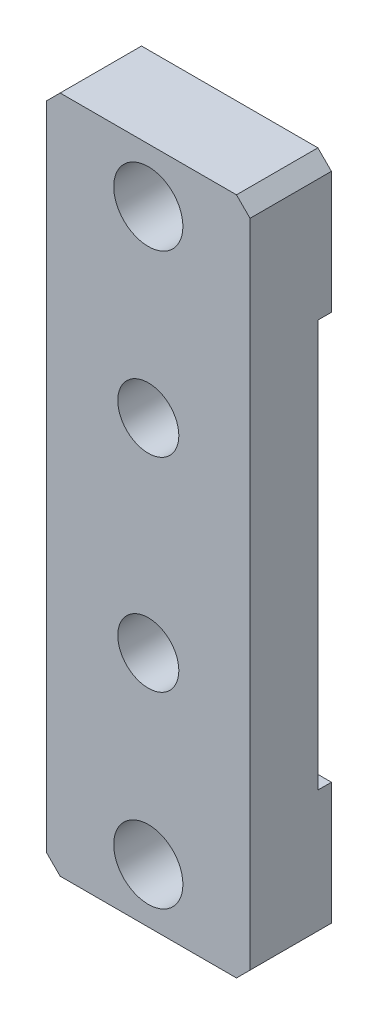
ISO-10303-21;
HEADER;
FILE_DESCRIPTION(('STEP AP214'),'2;1');
FILE_NAME('part.step','',(''),(''),'','','');
FILE_SCHEMA(('AUTOMOTIVE_DESIGN { 1 0 10303 214 1 1 1 1 }'));
ENDSEC;
DATA;
#1=APPLICATION_CONTEXT('core data for automotive mechanical design processes');
#2=APPLICATION_PROTOCOL_DEFINITION('international standard','automotive_design',2000,#1);
#3=PRODUCT_CONTEXT('',#1,'mechanical');
#4=PRODUCT('Part','Part','',(#3));
#5=PRODUCT_RELATED_PRODUCT_CATEGORY('part','',(#4));
#6=PRODUCT_DEFINITION_FORMATION('','',#4);
#7=PRODUCT_DEFINITION_CONTEXT('part definition',#1,'design');
#8=PRODUCT_DEFINITION('design','',#6,#7);
#9=PRODUCT_DEFINITION_SHAPE('','',#8);
#10=(LENGTH_UNIT() NAMED_UNIT(*) SI_UNIT(.MILLI.,.METRE.));
#11=(NAMED_UNIT(*) PLANE_ANGLE_UNIT() SI_UNIT($,.RADIAN.));
#12=(NAMED_UNIT(*) SI_UNIT($,.STERADIAN.) SOLID_ANGLE_UNIT());
#13=UNCERTAINTY_MEASURE_WITH_UNIT(LENGTH_MEASURE(1.E-05),#10,'distance_accuracy_value','');
#14=(GEOMETRIC_REPRESENTATION_CONTEXT(3) GLOBAL_UNCERTAINTY_ASSIGNED_CONTEXT((#13)) GLOBAL_UNIT_ASSIGNED_CONTEXT((#10,
#11,#12)) REPRESENTATION_CONTEXT('',''));
#15=CARTESIAN_POINT('',(0.,0.,0.));
#16=DIRECTION('',(0.,0.,1.));
#17=DIRECTION('',(1.,0.,0.));
#18=AXIS2_PLACEMENT_3D('',#15,#16,#17);
#19=CARTESIAN_POINT('',(0.,0.,0.));
#20=DIRECTION('',(0.,0.,1.));
#21=DIRECTION('',(1.,0.,0.));
#22=AXIS2_PLACEMENT_3D('',#19,#20,#21);
#23=PLANE('',#22);
#24=CARTESIAN_POINT('',(0.,-42.,0.));
#25=DIRECTION('',(0.,0.,1.));
#26=DIRECTION('',(1.,0.,0.));
#27=AXIS2_PLACEMENT_3D('',#24,#25,#26);
#28=CIRCLE('',#27,5.1);
#29=CARTESIAN_POINT('',(5.09999999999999,-42.,0.));
#30=VERTEX_POINT('',#29);
#31=EDGE_CURVE('E137',#30,#30,#28,.T.);
#32=ORIENTED_EDGE('',*,*,#31,.T.);
#33=EDGE_LOOP('',(#32));
#34=FACE_BOUND('',#33,.T.);
#35=DIRECTION('',(1.,0.,0.));
#36=VECTOR('',#35,1.);
#37=CARTESIAN_POINT('',(-15.,-50.,0.));
#38=LINE('',#37,#36);
#39=CARTESIAN_POINT('',(-13.,-50.,0.));
#40=VERTEX_POINT('',#39);
#41=CARTESIAN_POINT('',(13.,-50.,0.));
#42=VERTEX_POINT('',#41);
#43=EDGE_CURVE('E153',#40,#42,#38,.T.);
#44=ORIENTED_EDGE('',*,*,#43,.F.);
#45=DIRECTION('',(0.707106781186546,-0.707106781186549,0.));
#46=VECTOR('',#45,1.);
#47=CARTESIAN_POINT('',(-13.,-50.,0.));
#48=LINE('',#47,#46);
#49=CARTESIAN_POINT('',(-15.,-48.,0.));
#50=VERTEX_POINT('',#49);
#51=EDGE_CURVE('E11',#40,#50,#48,.F.);
#52=ORIENTED_EDGE('',*,*,#51,.T.);
#53=DIRECTION('',(0.,-1.,0.));
#54=VECTOR('',#53,1.);
#55=CARTESIAN_POINT('',(-15.,50.,0.));
#56=LINE('',#55,#54);
#57=CARTESIAN_POINT('',(-15.,-30.,0.));
#58=VERTEX_POINT('',#57);
#59=EDGE_CURVE('E168',#58,#50,#56,.T.);
#60=ORIENTED_EDGE('',*,*,#59,.F.);
#61=DIRECTION('',(1.,0.,0.));
#62=VECTOR('',#61,1.);
#63=CARTESIAN_POINT('',(-15.,-30.,0.));
#64=LINE('',#63,#62);
#65=CARTESIAN_POINT('',(15.,-30.,0.));
#66=VERTEX_POINT('',#65);
#67=EDGE_CURVE('E143',#58,#66,#64,.T.);
#68=ORIENTED_EDGE('',*,*,#67,.T.);
#69=DIRECTION('',(0.,1.,0.));
#70=VECTOR('',#69,1.);
#71=CARTESIAN_POINT('',(15.,50.,0.));
#72=LINE('',#71,#70);
#73=CARTESIAN_POINT('',(15.,-48.,0.));
#74=VERTEX_POINT('',#73);
#75=EDGE_CURVE('E163',#74,#66,#72,.T.);
#76=ORIENTED_EDGE('',*,*,#75,.F.);
#77=DIRECTION('',(0.707106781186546,0.707106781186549,0.));
#78=VECTOR('',#77,1.);
#79=CARTESIAN_POINT('',(15.,-48.,0.));
#80=LINE('',#79,#78);
#81=EDGE_CURVE('E24',#74,#42,#80,.F.);
#82=ORIENTED_EDGE('',*,*,#81,.T.);
#83=EDGE_LOOP('',(#44,#52,#60,#68,#76,#82));
#84=FACE_BOUND('',#83,.T.);
#85=ADVANCED_FACE('F16',(#34,#84),#23,.F.);
#86=CARTESIAN_POINT('',(15.,50.,12.));
#87=DIRECTION('',(-1.,0.,0.));
#88=DIRECTION('',(0.,-1.,0.));
#89=AXIS2_PLACEMENT_3D('',#86,#87,#88);
#90=PLANE('',#89);
#91=CARTESIAN_POINT('',(15.,30.,0.));
#92=VERTEX_POINT('',#91);
#93=CARTESIAN_POINT('',(15.,48.,0.));
#94=VERTEX_POINT('',#93);
#95=EDGE_CURVE('E146',#92,#94,#72,.T.);
#96=ORIENTED_EDGE('',*,*,#95,.T.);
#97=DIRECTION('',(0.,0.,1.));
#98=VECTOR('',#97,1.);
#99=CARTESIAN_POINT('',(15.,48.,12.));
#100=LINE('',#99,#98);
#101=CARTESIAN_POINT('',(15.,48.,12.));
#102=VERTEX_POINT('',#101);
#103=EDGE_CURVE('E194',#94,#102,#100,.T.);
#104=ORIENTED_EDGE('',*,*,#103,.T.);
#105=DIRECTION('',(0.,1.,0.));
#106=VECTOR('',#105,1.);
#107=CARTESIAN_POINT('',(15.,50.,12.));
#108=LINE('',#107,#106);
#109=CARTESIAN_POINT('',(15.,-48.,12.));
#110=VERTEX_POINT('',#109);
#111=EDGE_CURVE('E149',#110,#102,#108,.T.);
#112=ORIENTED_EDGE('',*,*,#111,.F.);
#113=DIRECTION('',(0.,0.,-1.));
#114=VECTOR('',#113,1.);
#115=CARTESIAN_POINT('',(15.,-48.,12.));
#116=LINE('',#115,#114);
#117=EDGE_CURVE('E191',#110,#74,#116,.T.);
#118=ORIENTED_EDGE('',*,*,#117,.T.);
#119=ORIENTED_EDGE('',*,*,#75,.T.);
#120=DIRECTION('',(0.,0.,-1.));
#121=VECTOR('',#120,1.);
#122=CARTESIAN_POINT('',(15.,-30.,0.));
#123=LINE('',#122,#121);
#124=CARTESIAN_POINT('',(15.,-30.,2.));
#125=VERTEX_POINT('',#124);
#126=EDGE_CURVE('E131',#125,#66,#123,.T.);
#127=ORIENTED_EDGE('',*,*,#126,.F.);
#128=DIRECTION('',(0.,-1.,0.));
#129=VECTOR('',#128,1.);
#130=CARTESIAN_POINT('',(15.,30.,2.));
#131=LINE('',#130,#129);
#132=CARTESIAN_POINT('',(15.,30.,2.));
#133=VERTEX_POINT('',#132);
#134=EDGE_CURVE('E134',#133,#125,#131,.T.);
#135=ORIENTED_EDGE('',*,*,#134,.F.);
#136=DIRECTION('',(0.,0.,1.));
#137=VECTOR('',#136,1.);
#138=CARTESIAN_POINT('',(15.,30.,0.));
#139=LINE('',#138,#137);
#140=EDGE_CURVE('E111',#92,#133,#139,.T.);
#141=ORIENTED_EDGE('',*,*,#140,.F.);
#142=EDGE_LOOP('',(#96,#104,#112,#118,#119,#127,#135,#141));
#143=FACE_BOUND('',#142,.T.);
#144=ADVANCED_FACE('F229',(#143),#90,.F.);
#145=CARTESIAN_POINT('',(-15.,50.,12.));
#146=DIRECTION('',(0.,-1.,0.));
#147=DIRECTION('',(0.,0.,-1.));
#148=AXIS2_PLACEMENT_3D('',#145,#146,#147);
#149=PLANE('',#148);
#150=DIRECTION('',(-1.,0.,0.));
#151=VECTOR('',#150,1.);
#152=CARTESIAN_POINT('',(-15.,50.,0.));
#153=LINE('',#152,#151);
#154=CARTESIAN_POINT('',(13.,50.,0.));
#155=VERTEX_POINT('',#154);
#156=CARTESIAN_POINT('',(-13.,50.,0.));
#157=VERTEX_POINT('',#156);
#158=EDGE_CURVE('E165',#155,#157,#153,.T.);
#159=ORIENTED_EDGE('',*,*,#158,.T.);
#160=DIRECTION('',(0.,0.,1.));
#161=VECTOR('',#160,1.);
#162=CARTESIAN_POINT('',(-13.,50.,12.));
#163=LINE('',#162,#161);
#164=CARTESIAN_POINT('',(-13.,50.,12.));
#165=VERTEX_POINT('',#164);
#166=EDGE_CURVE('E181',#157,#165,#163,.T.);
#167=ORIENTED_EDGE('',*,*,#166,.T.);
#168=DIRECTION('',(-1.,0.,0.));
#169=VECTOR('',#168,1.);
#170=CARTESIAN_POINT('',(-15.,50.,12.));
#171=LINE('',#170,#169);
#172=CARTESIAN_POINT('',(13.,50.,12.));
#173=VERTEX_POINT('',#172);
#174=EDGE_CURVE('E152',#173,#165,#171,.T.);
#175=ORIENTED_EDGE('',*,*,#174,.F.);
#176=DIRECTION('',(0.,0.,-1.));
#177=VECTOR('',#176,1.);
#178=CARTESIAN_POINT('',(13.,50.,12.));
#179=LINE('',#178,#177);
#180=EDGE_CURVE('E178',#173,#155,#179,.T.);
#181=ORIENTED_EDGE('',*,*,#180,.T.);
#182=EDGE_LOOP('',(#159,#167,#175,#181));
#183=FACE_BOUND('',#182,.T.);
#184=ADVANCED_FACE('F219',(#183),#149,.F.);
#185=CARTESIAN_POINT('',(-15.,50.,12.));
#186=DIRECTION('',(1.,0.,0.));
#187=DIRECTION('',(0.,1.,0.));
#188=AXIS2_PLACEMENT_3D('',#185,#186,#187);
#189=PLANE('',#188);
#190=DIRECTION('',(0.,-1.,0.));
#191=VECTOR('',#190,1.);
#192=CARTESIAN_POINT('',(-15.,50.,12.));
#193=LINE('',#192,#191);
#194=CARTESIAN_POINT('',(-15.,48.,12.));
#195=VERTEX_POINT('',#194);
#196=CARTESIAN_POINT('',(-15.,-48.,12.));
#197=VERTEX_POINT('',#196);
#198=EDGE_CURVE('E156',#195,#197,#193,.T.);
#199=ORIENTED_EDGE('',*,*,#198,.F.);
#200=DIRECTION('',(0.,0.,-1.));
#201=VECTOR('',#200,1.);
#202=CARTESIAN_POINT('',(-15.,48.,12.));
#203=LINE('',#202,#201);
#204=CARTESIAN_POINT('',(-15.,48.,0.));
#205=VERTEX_POINT('',#204);
#206=EDGE_CURVE('E172',#195,#205,#203,.T.);
#207=ORIENTED_EDGE('',*,*,#206,.T.);
#208=CARTESIAN_POINT('',(-15.,30.,0.));
#209=VERTEX_POINT('',#208);
#210=EDGE_CURVE('E130',#205,#209,#56,.T.);
#211=ORIENTED_EDGE('',*,*,#210,.T.);
#212=DIRECTION('',(0.,0.,1.));
#213=VECTOR('',#212,1.);
#214=CARTESIAN_POINT('',(-15.,30.,0.));
#215=LINE('',#214,#213);
#216=CARTESIAN_POINT('',(-15.,30.,2.));
#217=VERTEX_POINT('',#216);
#218=EDGE_CURVE('E108',#209,#217,#215,.T.);
#219=ORIENTED_EDGE('',*,*,#218,.T.);
#220=DIRECTION('',(0.,-1.,0.));
#221=VECTOR('',#220,1.);
#222=CARTESIAN_POINT('',(-15.,30.,2.));
#223=LINE('',#222,#221);
#224=CARTESIAN_POINT('',(-15.,-30.,2.));
#225=VERTEX_POINT('',#224);
#226=EDGE_CURVE('E119',#217,#225,#223,.T.);
#227=ORIENTED_EDGE('',*,*,#226,.T.);
#228=DIRECTION('',(0.,0.,-1.));
#229=VECTOR('',#228,1.);
#230=CARTESIAN_POINT('',(-15.,-30.,0.));
#231=LINE('',#230,#229);
#232=EDGE_CURVE('E124',#225,#58,#231,.T.);
#233=ORIENTED_EDGE('',*,*,#232,.T.);
#234=ORIENTED_EDGE('',*,*,#59,.T.);
#235=DIRECTION('',(0.,0.,1.));
#236=VECTOR('',#235,1.);
#237=CARTESIAN_POINT('',(-15.,-48.,12.));
#238=LINE('',#237,#236);
#239=EDGE_CURVE('E162',#50,#197,#238,.T.);
#240=ORIENTED_EDGE('',*,*,#239,.T.);
#241=EDGE_LOOP('',(#199,#207,#211,#219,#227,#233,#234,#240));
#242=FACE_BOUND('',#241,.T.);
#243=ADVANCED_FACE('F127',(#242),#189,.F.);
#244=CARTESIAN_POINT('',(-15.,-50.,12.));
#245=DIRECTION('',(0.,1.,0.));
#246=DIRECTION('',(0.,0.,1.));
#247=AXIS2_PLACEMENT_3D('',#244,#245,#246);
#248=PLANE('',#247);
#249=DIRECTION('',(1.,0.,0.));
#250=VECTOR('',#249,1.);
#251=CARTESIAN_POINT('',(-15.,-50.,12.));
#252=LINE('',#251,#250);
#253=CARTESIAN_POINT('',(-13.,-50.,12.));
#254=VERTEX_POINT('',#253);
#255=CARTESIAN_POINT('',(13.,-50.,12.));
#256=VERTEX_POINT('',#255);
#257=EDGE_CURVE('E159',#254,#256,#252,.T.);
#258=ORIENTED_EDGE('',*,*,#257,.F.);
#259=DIRECTION('',(0.,0.,-1.));
#260=VECTOR('',#259,1.);
#261=CARTESIAN_POINT('',(-13.,-50.,12.));
#262=LINE('',#261,#260);
#263=EDGE_CURVE('E198',#254,#40,#262,.T.);
#264=ORIENTED_EDGE('',*,*,#263,.T.);
#265=ORIENTED_EDGE('',*,*,#43,.T.);
#266=DIRECTION('',(0.,0.,1.));
#267=VECTOR('',#266,1.);
#268=CARTESIAN_POINT('',(13.,-50.,12.));
#269=LINE('',#268,#267);
#270=EDGE_CURVE('E196',#42,#256,#269,.T.);
#271=ORIENTED_EDGE('',*,*,#270,.T.);
#272=EDGE_LOOP('',(#258,#264,#265,#271));
#273=FACE_BOUND('',#272,.T.);
#274=ADVANCED_FACE('F201',(#273),#248,.F.);
#275=CARTESIAN_POINT('',(0.,0.,12.));
#276=DIRECTION('',(0.,0.,1.));
#277=DIRECTION('',(1.,0.,0.));
#278=AXIS2_PLACEMENT_3D('',#275,#276,#277);
#279=PLANE('',#278);
#280=CARTESIAN_POINT('',(0.,15.,12.));
#281=DIRECTION('',(0.,0.,1.));
#282=DIRECTION('',(1.,0.,0.));
#283=AXIS2_PLACEMENT_3D('',#280,#281,#282);
#284=CIRCLE('',#283,4.5);
#285=CARTESIAN_POINT('',(4.5,15.,12.));
#286=VERTEX_POINT('',#285);
#287=EDGE_CURVE('E401',#286,#286,#284,.T.);
#288=ORIENTED_EDGE('',*,*,#287,.F.);
#289=EDGE_LOOP('',(#288));
#290=FACE_BOUND('',#289,.T.);
#291=CARTESIAN_POINT('',(0.,-15.,12.));
#292=DIRECTION('',(0.,0.,1.));
#293=DIRECTION('',(1.,0.,0.));
#294=AXIS2_PLACEMENT_3D('',#291,#292,#293);
#295=CIRCLE('',#294,4.5);
#296=CARTESIAN_POINT('',(4.5,-15.,12.));
#297=VERTEX_POINT('',#296);
#298=EDGE_CURVE('E405',#297,#297,#295,.T.);
#299=ORIENTED_EDGE('',*,*,#298,.F.);
#300=EDGE_LOOP('',(#299));
#301=FACE_BOUND('',#300,.T.);
#302=CARTESIAN_POINT('',(0.,42.,12.));
#303=DIRECTION('',(0.,0.,1.));
#304=DIRECTION('',(1.,0.,0.));
#305=AXIS2_PLACEMENT_3D('',#302,#303,#304);
#306=CIRCLE('',#305,5.1);
#307=CARTESIAN_POINT('',(5.1,42.,12.));
#308=VERTEX_POINT('',#307);
#309=EDGE_CURVE('E409',#308,#308,#306,.T.);
#310=ORIENTED_EDGE('',*,*,#309,.F.);
#311=EDGE_LOOP('',(#310));
#312=FACE_BOUND('',#311,.T.);
#313=CARTESIAN_POINT('',(0.,-42.,12.));
#314=DIRECTION('',(0.,0.,1.));
#315=DIRECTION('',(1.,0.,0.));
#316=AXIS2_PLACEMENT_3D('',#313,#314,#315);
#317=CIRCLE('',#316,5.1);
#318=CARTESIAN_POINT('',(5.09999999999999,-42.,12.));
#319=VERTEX_POINT('',#318);
#320=EDGE_CURVE('E412',#319,#319,#317,.T.);
#321=ORIENTED_EDGE('',*,*,#320,.F.);
#322=EDGE_LOOP('',(#321));
#323=FACE_BOUND('',#322,.T.);
#324=ORIENTED_EDGE('',*,*,#174,.T.);
#325=DIRECTION('',(0.707106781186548,0.707106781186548,0.));
#326=VECTOR('',#325,1.);
#327=CARTESIAN_POINT('',(-31.5,31.5,12.));
#328=LINE('',#327,#326);
#329=EDGE_CURVE('E189',#165,#195,#328,.F.);
#330=ORIENTED_EDGE('',*,*,#329,.T.);
#331=ORIENTED_EDGE('',*,*,#198,.T.);
#332=DIRECTION('',(-0.707106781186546,0.707106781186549,0.));
#333=VECTOR('',#332,1.);
#334=CARTESIAN_POINT('',(-31.5,-31.5,12.));
#335=LINE('',#334,#333);
#336=EDGE_CURVE('E185',#197,#254,#335,.F.);
#337=ORIENTED_EDGE('',*,*,#336,.T.);
#338=ORIENTED_EDGE('',*,*,#257,.T.);
#339=DIRECTION('',(-0.707106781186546,-0.707106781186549,0.));
#340=VECTOR('',#339,1.);
#341=CARTESIAN_POINT('',(31.5,-31.5,12.));
#342=LINE('',#341,#340);
#343=EDGE_CURVE('E183',#256,#110,#342,.F.);
#344=ORIENTED_EDGE('',*,*,#343,.T.);
#345=ORIENTED_EDGE('',*,*,#111,.T.);
#346=DIRECTION('',(0.707106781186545,-0.70710678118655,0.));
#347=VECTOR('',#346,1.);
#348=CARTESIAN_POINT('',(31.5,31.5,12.));
#349=LINE('',#348,#347);
#350=EDGE_CURVE('E187',#102,#173,#349,.F.);
#351=ORIENTED_EDGE('',*,*,#350,.T.);
#352=EDGE_LOOP('',(#324,#330,#331,#337,#338,#344,#345,#351));
#353=FACE_BOUND('',#352,.T.);
#354=ADVANCED_FACE('F208',(#290,#301,#312,#323,#353),#279,.T.);
#355=CARTESIAN_POINT('',(0.,42.,0.));
#356=DIRECTION('',(0.,0.,1.));
#357=DIRECTION('',(1.,0.,0.));
#358=AXIS2_PLACEMENT_3D('',#355,#356,#357);
#359=CIRCLE('',#358,5.1);
#360=CARTESIAN_POINT('',(5.1,42.,0.));
#361=VERTEX_POINT('',#360);
#362=EDGE_CURVE('E414',#361,#361,#359,.T.);
#363=ORIENTED_EDGE('',*,*,#362,.T.);
#364=EDGE_LOOP('',(#363));
#365=FACE_BOUND('',#364,.T.);
#366=ORIENTED_EDGE('',*,*,#210,.F.);
#367=DIRECTION('',(-0.707106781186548,-0.707106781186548,0.));
#368=VECTOR('',#367,1.);
#369=CARTESIAN_POINT('',(-15.,48.,0.));
#370=LINE('',#369,#368);
#371=EDGE_CURVE('E176',#205,#157,#370,.F.);
#372=ORIENTED_EDGE('',*,*,#371,.T.);
#373=ORIENTED_EDGE('',*,*,#158,.F.);
#374=DIRECTION('',(-0.707106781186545,0.70710678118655,0.));
#375=VECTOR('',#374,1.);
#376=CARTESIAN_POINT('',(13.,50.,0.));
#377=LINE('',#376,#375);
#378=EDGE_CURVE('E174',#155,#94,#377,.F.);
#379=ORIENTED_EDGE('',*,*,#378,.T.);
#380=ORIENTED_EDGE('',*,*,#95,.F.);
#381=DIRECTION('',(1.,0.,0.));
#382=VECTOR('',#381,1.);
#383=CARTESIAN_POINT('',(-15.,30.,0.));
#384=LINE('',#383,#382);
#385=EDGE_CURVE('E116',#209,#92,#384,.T.);
#386=ORIENTED_EDGE('',*,*,#385,.F.);
#387=EDGE_LOOP('',(#366,#372,#373,#379,#380,#386));
#388=FACE_BOUND('',#387,.T.);
#389=ADVANCED_FACE('F217',(#365,#388),#23,.F.);
#390=CARTESIAN_POINT('',(-15.,-30.,0.));
#391=DIRECTION('',(0.,-1.,0.));
#392=DIRECTION('',(0.,0.,-1.));
#393=AXIS2_PLACEMENT_3D('',#390,#391,#392);
#394=PLANE('',#393);
#395=ORIENTED_EDGE('',*,*,#126,.T.);
#396=ORIENTED_EDGE('',*,*,#67,.F.);
#397=ORIENTED_EDGE('',*,*,#232,.F.);
#398=DIRECTION('',(1.,0.,0.));
#399=VECTOR('',#398,1.);
#400=CARTESIAN_POINT('',(-15.,-30.,2.));
#401=LINE('',#400,#399);
#402=EDGE_CURVE('E115',#225,#125,#401,.T.);
#403=ORIENTED_EDGE('',*,*,#402,.T.);
#404=EDGE_LOOP('',(#395,#396,#397,#403));
#405=FACE_BOUND('',#404,.T.);
#406=ADVANCED_FACE('F233',(#405),#394,.F.);
#407=CARTESIAN_POINT('',(-15.,30.,2.));
#408=DIRECTION('',(0.,0.,1.));
#409=DIRECTION('',(0.,-1.,0.));
#410=AXIS2_PLACEMENT_3D('',#407,#408,#409);
#411=PLANE('',#410);
#412=CARTESIAN_POINT('',(0.,15.,2.));
#413=DIRECTION('',(0.,0.,1.));
#414=DIRECTION('',(0.,-1.,0.));
#415=AXIS2_PLACEMENT_3D('',#412,#413,#414);
#416=CIRCLE('',#415,4.5);
#417=CARTESIAN_POINT('',(0.,10.5,2.));
#418=VERTEX_POINT('',#417);
#419=EDGE_CURVE('E423',#418,#418,#416,.T.);
#420=ORIENTED_EDGE('',*,*,#419,.T.);
#421=EDGE_LOOP('',(#420));
#422=FACE_BOUND('',#421,.T.);
#423=CARTESIAN_POINT('',(0.,-15.,2.));
#424=DIRECTION('',(0.,0.,1.));
#425=DIRECTION('',(0.,-1.,0.));
#426=AXIS2_PLACEMENT_3D('',#423,#424,#425);
#427=CIRCLE('',#426,4.5);
#428=CARTESIAN_POINT('',(0.,-19.5,2.));
#429=VERTEX_POINT('',#428);
#430=EDGE_CURVE('E419',#429,#429,#427,.T.);
#431=ORIENTED_EDGE('',*,*,#430,.T.);
#432=EDGE_LOOP('',(#431));
#433=FACE_BOUND('',#432,.T.);
#434=ORIENTED_EDGE('',*,*,#134,.T.);
#435=ORIENTED_EDGE('',*,*,#402,.F.);
#436=ORIENTED_EDGE('',*,*,#226,.F.);
#437=DIRECTION('',(1.,0.,0.));
#438=VECTOR('',#437,1.);
#439=CARTESIAN_POINT('',(-15.,30.,2.));
#440=LINE('',#439,#438);
#441=EDGE_CURVE('E104',#217,#133,#440,.T.);
#442=ORIENTED_EDGE('',*,*,#441,.T.);
#443=EDGE_LOOP('',(#434,#435,#436,#442));
#444=FACE_BOUND('',#443,.T.);
#445=ADVANCED_FACE('F120',(#422,#433,#444),#411,.F.);
#446=CARTESIAN_POINT('',(-15.,30.,0.));
#447=DIRECTION('',(0.,1.,0.));
#448=DIRECTION('',(0.,0.,1.));
#449=AXIS2_PLACEMENT_3D('',#446,#447,#448);
#450=PLANE('',#449);
#451=ORIENTED_EDGE('',*,*,#140,.T.);
#452=ORIENTED_EDGE('',*,*,#441,.F.);
#453=ORIENTED_EDGE('',*,*,#218,.F.);
#454=ORIENTED_EDGE('',*,*,#385,.T.);
#455=EDGE_LOOP('',(#451,#452,#453,#454));
#456=FACE_BOUND('',#455,.T.);
#457=ADVANCED_FACE('F106',(#456),#450,.F.);
#458=CARTESIAN_POINT('',(0.,-42.,12.));
#459=DIRECTION('',(0.,0.,1.));
#460=DIRECTION('',(1.,0.,0.));
#461=AXIS2_PLACEMENT_3D('',#458,#459,#460);
#462=CYLINDRICAL_SURFACE('',#461,5.1);
#463=ORIENTED_EDGE('',*,*,#31,.F.);
#464=EDGE_LOOP('',(#463));
#465=FACE_BOUND('',#464,.T.);
#466=ORIENTED_EDGE('',*,*,#320,.T.);
#467=EDGE_LOOP('',(#466));
#468=FACE_BOUND('',#467,.T.);
#469=ADVANCED_FACE('F329',(#465,#468),#462,.F.);
#470=CARTESIAN_POINT('',(0.,42.,12.));
#471=DIRECTION('',(0.,0.,1.));
#472=DIRECTION('',(1.,0.,0.));
#473=AXIS2_PLACEMENT_3D('',#470,#471,#472);
#474=CYLINDRICAL_SURFACE('',#473,5.1);
#475=ORIENTED_EDGE('',*,*,#362,.F.);
#476=EDGE_LOOP('',(#475));
#477=FACE_BOUND('',#476,.T.);
#478=ORIENTED_EDGE('',*,*,#309,.T.);
#479=EDGE_LOOP('',(#478));
#480=FACE_BOUND('',#479,.T.);
#481=ADVANCED_FACE('F318',(#477,#480),#474,.F.);
#482=CARTESIAN_POINT('',(0.,-15.,12.));
#483=DIRECTION('',(0.,0.,1.));
#484=DIRECTION('',(1.,0.,0.));
#485=AXIS2_PLACEMENT_3D('',#482,#483,#484);
#486=CYLINDRICAL_SURFACE('',#485,4.5);
#487=ORIENTED_EDGE('',*,*,#298,.T.);
#488=EDGE_LOOP('',(#487));
#489=FACE_BOUND('',#488,.T.);
#490=ORIENTED_EDGE('',*,*,#430,.F.);
#491=EDGE_LOOP('',(#490));
#492=FACE_BOUND('',#491,.T.);
#493=ADVANCED_FACE('F307',(#489,#492),#486,.F.);
#494=CARTESIAN_POINT('',(0.,15.,12.));
#495=DIRECTION('',(0.,0.,1.));
#496=DIRECTION('',(1.,0.,0.));
#497=AXIS2_PLACEMENT_3D('',#494,#495,#496);
#498=CYLINDRICAL_SURFACE('',#497,4.5);
#499=ORIENTED_EDGE('',*,*,#287,.T.);
#500=EDGE_LOOP('',(#499));
#501=FACE_BOUND('',#500,.T.);
#502=ORIENTED_EDGE('',*,*,#419,.F.);
#503=EDGE_LOOP('',(#502));
#504=FACE_BOUND('',#503,.T.);
#505=ADVANCED_FACE('F266',(#501,#504),#498,.F.);
#506=CARTESIAN_POINT('',(-15.,48.,12.));
#507=DIRECTION('',(0.707106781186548,-0.707106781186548,0.));
#508=DIRECTION('',(0.,0.,-1.));
#509=AXIS2_PLACEMENT_3D('',#506,#507,#508);
#510=PLANE('',#509);
#511=ORIENTED_EDGE('',*,*,#329,.F.);
#512=ORIENTED_EDGE('',*,*,#166,.F.);
#513=ORIENTED_EDGE('',*,*,#371,.F.);
#514=ORIENTED_EDGE('',*,*,#206,.F.);
#515=EDGE_LOOP('',(#511,#512,#513,#514));
#516=FACE_BOUND('',#515,.T.);
#517=ADVANCED_FACE('F213',(#516),#510,.F.);
#518=CARTESIAN_POINT('',(13.,50.,12.));
#519=DIRECTION('',(-0.70710678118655,-0.707106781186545,0.));
#520=DIRECTION('',(0.,0.,-1.));
#521=AXIS2_PLACEMENT_3D('',#518,#519,#520);
#522=PLANE('',#521);
#523=ORIENTED_EDGE('',*,*,#350,.F.);
#524=ORIENTED_EDGE('',*,*,#103,.F.);
#525=ORIENTED_EDGE('',*,*,#378,.F.);
#526=ORIENTED_EDGE('',*,*,#180,.F.);
#527=EDGE_LOOP('',(#523,#524,#525,#526));
#528=FACE_BOUND('',#527,.T.);
#529=ADVANCED_FACE('F224',(#528),#522,.F.);
#530=CARTESIAN_POINT('',(-13.,-50.,12.));
#531=DIRECTION('',(0.707106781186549,0.707106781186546,0.));
#532=DIRECTION('',(0.,0.,-1.));
#533=AXIS2_PLACEMENT_3D('',#530,#531,#532);
#534=PLANE('',#533);
#535=ORIENTED_EDGE('',*,*,#336,.F.);
#536=ORIENTED_EDGE('',*,*,#239,.F.);
#537=ORIENTED_EDGE('',*,*,#51,.F.);
#538=ORIENTED_EDGE('',*,*,#263,.F.);
#539=EDGE_LOOP('',(#535,#536,#537,#538));
#540=FACE_BOUND('',#539,.T.);
#541=ADVANCED_FACE('F206',(#540),#534,.F.);
#542=CARTESIAN_POINT('',(15.,-48.,12.));
#543=DIRECTION('',(-0.707106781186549,0.707106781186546,0.));
#544=DIRECTION('',(0.,0.,-1.));
#545=AXIS2_PLACEMENT_3D('',#542,#543,#544);
#546=PLANE('',#545);
#547=ORIENTED_EDGE('',*,*,#343,.F.);
#548=ORIENTED_EDGE('',*,*,#270,.F.);
#549=ORIENTED_EDGE('',*,*,#81,.F.);
#550=ORIENTED_EDGE('',*,*,#117,.F.);
#551=EDGE_LOOP('',(#547,#548,#549,#550));
#552=FACE_BOUND('',#551,.T.);
#553=ADVANCED_FACE('F18',(#552),#546,.F.);
#554=CLOSED_SHELL('',(#85,#144,#184,#243,#274,#354,#389,#406,#445,#457,#469,#481,#493,#505,#517,
#529,#541,#553));
#555=MANIFOLD_SOLID_BREP('B1',#554);
#556=ADVANCED_BREP_SHAPE_REPRESENTATION('',(#18,#555),#14);
#557=SHAPE_DEFINITION_REPRESENTATION(#9,#556);
ENDSEC;
END-ISO-10303-21;
